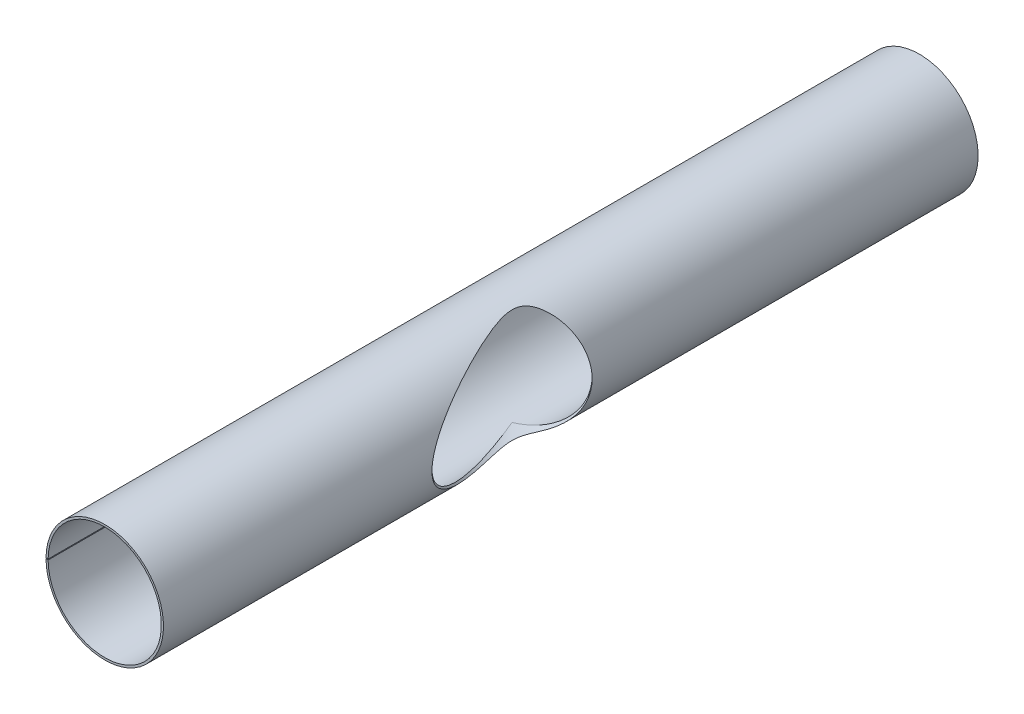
ISO-10303-21;
HEADER;
FILE_DESCRIPTION(('STEP AP214'),'2;1');
FILE_NAME('part.step','',(''),(''),'','','');
FILE_SCHEMA(('AUTOMOTIVE_DESIGN { 1 0 10303 214 1 1 1 1 }'));
ENDSEC;
DATA;
#1=APPLICATION_CONTEXT('core data for automotive mechanical design processes');
#2=APPLICATION_PROTOCOL_DEFINITION('international standard','automotive_design',2000,#1);
#3=PRODUCT_CONTEXT('',#1,'mechanical');
#4=PRODUCT('Part','Part','',(#3));
#5=PRODUCT_RELATED_PRODUCT_CATEGORY('part','',(#4));
#6=PRODUCT_DEFINITION_FORMATION('','',#4);
#7=PRODUCT_DEFINITION_CONTEXT('part definition',#1,'design');
#8=PRODUCT_DEFINITION('design','',#6,#7);
#9=PRODUCT_DEFINITION_SHAPE('','',#8);
#10=(LENGTH_UNIT() NAMED_UNIT(*) SI_UNIT(.MILLI.,.METRE.));
#11=(NAMED_UNIT(*) PLANE_ANGLE_UNIT() SI_UNIT($,.RADIAN.));
#12=(NAMED_UNIT(*) SI_UNIT($,.STERADIAN.) SOLID_ANGLE_UNIT());
#13=UNCERTAINTY_MEASURE_WITH_UNIT(LENGTH_MEASURE(1.E-05),#10,'distance_accuracy_value','');
#14=(GEOMETRIC_REPRESENTATION_CONTEXT(3) GLOBAL_UNCERTAINTY_ASSIGNED_CONTEXT((#13)) GLOBAL_UNIT_ASSIGNED_CONTEXT((#10,
#11,#12)) REPRESENTATION_CONTEXT('',''));
#15=CARTESIAN_POINT('',(0.,0.,0.));
#16=DIRECTION('',(0.,0.,1.));
#17=DIRECTION('',(1.,0.,0.));
#18=AXIS2_PLACEMENT_3D('',#15,#16,#17);
#19=CARTESIAN_POINT('',(0.,0.,500.));
#20=DIRECTION('',(0.,0.,-1.));
#21=DIRECTION('',(-1.,0.,0.));
#22=AXIS2_PLACEMENT_3D('',#19,#20,#21);
#23=CYLINDRICAL_SURFACE('',#22,72.1);
#24=CARTESIAN_POINT('',(62.9616539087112,-35.1317539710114,147.767430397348));
#25=CARTESIAN_POINT('',(63.4222890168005,-34.3062233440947,148.91203652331));
#26=CARTESIAN_POINT('',(63.8765526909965,-33.4540330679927,150.040042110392));
#27=CARTESIAN_POINT('',(64.7694261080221,-31.6908219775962,152.255859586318));
#28=CARTESIAN_POINT('',(65.2080352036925,-30.7797987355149,153.343669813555));
#29=CARTESIAN_POINT('',(66.0658621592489,-28.8926729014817,155.470060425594));
#30=CARTESIAN_POINT('',(66.4850760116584,-27.9165569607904,156.508630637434));
#31=CARTESIAN_POINT('',(67.299002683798,-25.8929244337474,158.524115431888));
#32=CARTESIAN_POINT('',(67.6937210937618,-24.8454242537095,159.501044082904));
#33=CARTESIAN_POINT('',(68.3649570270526,-22.9222051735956,161.161667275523));
#34=CARTESIAN_POINT('',(68.6477892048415,-22.062345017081,161.86114844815));
#35=CARTESIAN_POINT('',(69.1913219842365,-20.2935214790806,163.204993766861));
#36=CARTESIAN_POINT('',(69.4520213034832,-19.3845552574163,163.84935471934));
#37=CARTESIAN_POINT('',(69.9462679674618,-17.51743589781,165.070664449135));
#38=CARTESIAN_POINT('',(70.1798609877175,-16.5593695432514,165.647726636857));
#39=CARTESIAN_POINT('',(70.6149871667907,-14.5926887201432,166.722429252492));
#40=CARTESIAN_POINT('',(70.8165331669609,-13.5840947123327,167.220101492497));
#41=CARTESIAN_POINT('',(71.1310486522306,-11.8050393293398,167.996599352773));
#42=CARTESIAN_POINT('',(71.2530932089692,-11.0459507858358,168.297868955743));
#43=CARTESIAN_POINT('',(71.4749649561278,-9.50499596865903,168.845510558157));
#44=CARTESIAN_POINT('',(71.5747948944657,-8.72313252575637,169.091889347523));
#45=CARTESIAN_POINT('',(71.7499215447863,-7.14084107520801,169.524067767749));
#46=CARTESIAN_POINT('',(71.8252411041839,-6.34043110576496,169.709923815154));
#47=CARTESIAN_POINT('',(71.9495582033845,-4.72514994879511,170.016670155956));
#48=CARTESIAN_POINT('',(71.9985557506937,-3.91027876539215,170.137560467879));
#49=CARTESIAN_POINT('',(72.0690513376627,-2.26747223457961,170.311488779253));
#50=CARTESIAN_POINT('',(72.0903942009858,-1.4394893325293,170.364143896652));
#51=CARTESIAN_POINT('',(72.1044339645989,0.218207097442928,170.398781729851));
#52=CARTESIAN_POINT('',(72.097130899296,1.04792062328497,170.380764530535));
#53=CARTESIAN_POINT('',(72.0540927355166,2.70237599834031,170.274582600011));
#54=CARTESIAN_POINT('',(72.0183470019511,3.52711587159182,170.186391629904));
#55=CARTESIAN_POINT('',(71.9194541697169,5.16479956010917,169.942391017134));
#56=CARTESIAN_POINT('',(71.8563070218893,5.97774335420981,169.786581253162));
#57=CARTESIAN_POINT('',(71.7095491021,7.53106796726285,169.424438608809));
#58=CARTESIAN_POINT('',(71.627640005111,8.27259998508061,169.222306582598));
#59=CARTESIAN_POINT('',(71.4432793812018,9.7371758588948,168.76730341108));
#60=CARTESIAN_POINT('',(71.3408293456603,10.4602210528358,168.514435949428));
#61=CARTESIAN_POINT('',(71.1172681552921,11.8854822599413,167.96257580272));
#62=CARTESIAN_POINT('',(70.9961555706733,12.5876966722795,167.663579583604));
#63=CARTESIAN_POINT('',(70.7371579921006,13.9699354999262,167.024092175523));
#64=CARTESIAN_POINT('',(70.5992684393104,14.6499538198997,166.683589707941));
#65=CARTESIAN_POINT('',(70.3286472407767,15.8946277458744,166.015217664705));
#66=CARTESIAN_POINT('',(70.197827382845,16.4622583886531,165.692083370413));
#67=CARTESIAN_POINT('',(69.9262484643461,17.5801176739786,165.021166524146));
#68=CARTESIAN_POINT('',(69.7854909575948,18.1303490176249,164.673387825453));
#69=CARTESIAN_POINT('',(69.3496371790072,19.7559505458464,163.596325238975));
#70=CARTESIAN_POINT('',(69.0410724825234,20.8057178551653,162.833593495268));
#71=CARTESIAN_POINT('',(68.3944836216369,22.8418242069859,161.23471472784));
#72=CARTESIAN_POINT('',(68.056387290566,23.8279970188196,160.39838781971));
#73=CARTESIAN_POINT('',(67.3568105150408,25.7391882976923,158.667167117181));
#74=CARTESIAN_POINT('',(66.9953207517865,26.6641820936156,157.772249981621));
#75=CARTESIAN_POINT('',(66.2724383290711,28.4116461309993,155.981827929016));
#76=CARTESIAN_POINT('',(65.9119818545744,29.2369393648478,155.088682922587));
#77=CARTESIAN_POINT('',(65.1771207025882,30.8404040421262,153.266957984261));
#78=CARTESIAN_POINT('',(64.802718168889,31.6185826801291,152.33838349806));
#79=CARTESIAN_POINT('',(64.0419391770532,33.1324348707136,150.45055071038));
#80=CARTESIAN_POINT('',(63.6555521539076,33.8680691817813,149.491265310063));
#81=CARTESIAN_POINT('',(62.873017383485,35.299561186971,147.547356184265));
#82=CARTESIAN_POINT('',(62.4768692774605,35.9954174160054,146.562731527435));
#83=CARTESIAN_POINT('',(61.6754482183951,37.3519892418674,144.569572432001));
#84=CARTESIAN_POINT('',(61.2701563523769,38.0126202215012,143.560988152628));
#85=CARTESIAN_POINT('',(60.4526139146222,39.2997798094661,141.525136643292));
#86=CARTESIAN_POINT('',(60.0403634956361,39.9263091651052,140.497869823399));
#87=CARTESIAN_POINT('',(59.210109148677,41.1475138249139,138.427492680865));
#88=CARTESIAN_POINT('',(58.7921075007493,41.74220131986,137.384388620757));
#89=CARTESIAN_POINT('',(57.9510646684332,42.9021827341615,135.283946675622));
#90=CARTESIAN_POINT('',(57.5280233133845,43.467475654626,134.226608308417));
#91=CARTESIAN_POINT('',(56.6080094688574,44.6609480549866,131.925177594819));
#92=CARTESIAN_POINT('',(56.1102781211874,45.2842600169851,130.678865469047));
#93=CARTESIAN_POINT('',(55.110002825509,46.4963975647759,128.171432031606));
#94=CARTESIAN_POINT('',(54.6074586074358,47.0852212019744,126.910309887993));
#95=CARTESIAN_POINT('',(53.5983294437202,48.230818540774,124.374844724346));
#96=CARTESIAN_POINT('',(53.0917436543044,48.787585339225,123.100498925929));
#97=CARTESIAN_POINT('',(52.075392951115,49.8709843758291,120.540365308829));
#98=CARTESIAN_POINT('',(51.565628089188,50.3976171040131,119.254577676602));
#99=CARTESIAN_POINT('',(50.5430212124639,51.4231260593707,116.671381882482));
#100=CARTESIAN_POINT('',(50.0301764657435,51.9219716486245,115.37396265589));
#101=CARTESIAN_POINT('',(49.002560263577,52.8928987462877,112.769911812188));
#102=CARTESIAN_POINT('',(48.487788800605,53.3649801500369,111.463280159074));
#103=CARTESIAN_POINT('',(47.4569419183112,54.2837478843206,108.841824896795));
#104=CARTESIAN_POINT('',(46.9408666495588,54.7304370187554,107.527002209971));
#105=CARTESIAN_POINT('',(45.9078839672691,55.5997470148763,104.889724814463));
#106=CARTESIAN_POINT('',(45.3909765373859,56.0223673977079,103.567269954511));
#107=CARTESIAN_POINT('',(44.3570657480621,56.8444962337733,100.915868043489));
#108=CARTESIAN_POINT('',(43.8400624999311,57.2440134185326,99.5869236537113));
#109=CARTESIAN_POINT('',(42.8062881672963,58.0211153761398,96.9225244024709));
#110=CARTESIAN_POINT('',(42.2895170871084,58.3986997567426,95.5870694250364));
#111=CARTESIAN_POINT('',(41.2567621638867,59.1328246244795,92.910062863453));
#112=CARTESIAN_POINT('',(40.7407783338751,59.489364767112,91.5685111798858));
#113=CARTESIAN_POINT('',(39.7101962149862,60.1821886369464,88.8796563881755));
#114=CARTESIAN_POINT('',(39.1955979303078,60.5184723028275,87.5323532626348));
#115=CARTESIAN_POINT('',(38.1687759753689,61.1712711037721,84.8331401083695));
#116=CARTESIAN_POINT('',(37.6565509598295,61.4877991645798,83.481233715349));
#117=CARTESIAN_POINT('',(36.6348639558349,62.1019482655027,80.7721101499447));
#118=CARTESIAN_POINT('',(36.1254019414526,62.3995694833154,79.4148930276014));
#119=CARTESIAN_POINT('',(35.1100928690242,62.9764420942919,76.6952825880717));
#120=CARTESIAN_POINT('',(34.6042456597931,63.2556942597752,75.332889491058));
#121=CARTESIAN_POINT('',(33.5971291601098,63.7963127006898,72.6028885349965));
#122=CARTESIAN_POINT('',(33.095859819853,64.0576791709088,71.2352807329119));
#123=CARTESIAN_POINT('',(32.1997632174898,64.5118909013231,68.7715703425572));
#124=CARTESIAN_POINT('',(31.8038900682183,64.7079120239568,67.6764323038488));
#125=CARTESIAN_POINT('',(31.0165379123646,65.0889825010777,65.4826930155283));
#126=CARTESIAN_POINT('',(30.6250588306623,65.2740320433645,64.3840918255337));
#127=CARTESIAN_POINT('',(29.8473160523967,65.6333087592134,62.1831864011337));
#128=CARTESIAN_POINT('',(29.4610527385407,65.8075351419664,61.0808819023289));
#129=CARTESIAN_POINT('',(28.6948038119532,66.1452456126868,58.8724446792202));
#130=CARTESIAN_POINT('',(28.3148182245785,66.3087296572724,57.7663119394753));
#131=CARTESIAN_POINT('',(27.561823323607,66.6252424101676,55.5482799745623));
#132=CARTESIAN_POINT('',(27.1888254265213,66.7782549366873,54.4363745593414));
#133=CARTESIAN_POINT('',(26.4519757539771,67.0735453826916,52.2081161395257));
#134=CARTESIAN_POINT('',(26.0881239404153,67.2158233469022,51.0917631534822));
#135=CARTESIAN_POINT('',(25.3716242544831,67.4895377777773,48.8543889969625));
#136=CARTESIAN_POINT('',(25.0189741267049,67.6209764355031,47.7333688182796));
#137=CARTESIAN_POINT('',(24.3273328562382,67.8728683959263,45.4858914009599));
#138=CARTESIAN_POINT('',(23.9883415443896,67.9933218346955,44.3594342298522));
#139=CARTESIAN_POINT('',(23.3971569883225,68.1986748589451,42.3390374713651));
#140=CARTESIAN_POINT('',(23.141756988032,68.2857094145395,41.4462541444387));
#141=CARTESIAN_POINT('',(22.6436017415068,68.4525110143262,39.6564961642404));
#142=CARTESIAN_POINT('',(22.4008462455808,68.5322782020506,38.7595215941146));
#143=CARTESIAN_POINT('',(21.9303991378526,68.6842684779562,36.9602349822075));
#144=CARTESIAN_POINT('',(21.7027192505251,68.756485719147,36.0579193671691));
#145=CARTESIAN_POINT('',(21.2659595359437,68.8928246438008,34.2481827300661));
#146=CARTESIAN_POINT('',(21.0568792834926,68.9569465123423,33.3407618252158));
#147=CARTESIAN_POINT('',(20.6620915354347,69.0762649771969,31.5226479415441));
#148=CARTESIAN_POINT('',(20.4763260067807,69.1314838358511,30.6119691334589));
#149=CARTESIAN_POINT('',(20.1330261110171,69.232241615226,28.7845849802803));
#150=CARTESIAN_POINT('',(19.9754952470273,69.2777793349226,27.867878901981));
#151=CARTESIAN_POINT('',(19.6960360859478,69.357748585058,26.029712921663));
#152=CARTESIAN_POINT('',(19.5740611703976,69.392194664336,25.1082608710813));
#153=CARTESIAN_POINT('',(19.3747015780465,69.4481232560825,23.2602810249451));
#154=CARTESIAN_POINT('',(19.2973007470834,69.4696104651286,22.3337551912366));
#155=CARTESIAN_POINT('',(19.2070374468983,69.494615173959,20.6326279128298));
#156=CARTESIAN_POINT('',(19.1855443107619,69.5005375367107,19.8585414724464));
#157=CARTESIAN_POINT('',(19.1897252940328,69.49938578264,18.310247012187));
#158=CARTESIAN_POINT('',(19.2154028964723,69.4923107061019,17.5360389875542));
#159=CARTESIAN_POINT('',(19.3226022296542,69.4625818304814,15.9944028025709));
#160=CARTESIAN_POINT('',(19.403920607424,69.4399847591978,15.2269602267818));
#161=CARTESIAN_POINT('',(19.6306641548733,69.3762289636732,13.7022984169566));
#162=CARTESIAN_POINT('',(19.7760694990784,69.3350759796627,12.9450760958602));
#163=CARTESIAN_POINT('',(20.1076400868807,69.23956375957,11.5710808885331));
#164=CARTESIAN_POINT('',(20.2832858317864,69.1884542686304,10.9515483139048));
#165=CARTESIAN_POINT('',(20.6850124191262,69.0694154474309,9.73072215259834));
#166=CARTESIAN_POINT('',(20.9110864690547,69.0014883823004,9.12942612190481));
#167=CARTESIAN_POINT('',(21.41237503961,68.8475761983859,7.94981251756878));
#168=CARTESIAN_POINT('',(21.6876080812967,68.7615842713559,7.37150370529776));
#169=CARTESIAN_POINT('',(22.2831479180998,68.5709050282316,6.24180237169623));
#170=CARTESIAN_POINT('',(22.6034620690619,68.4662146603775,5.69041426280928));
#171=CARTESIAN_POINT('',(23.3777081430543,68.2063196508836,4.46761834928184));
#172=CARTESIAN_POINT('',(23.8440595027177,68.0451579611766,3.80533718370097));
#173=CARTESIAN_POINT('',(24.8271688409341,67.6926463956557,2.52800105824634));
#174=CARTESIAN_POINT('',(25.3439472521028,67.5012842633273,1.91296542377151));
#175=CARTESIAN_POINT('',(26.4168539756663,67.0886836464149,0.72471396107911));
#176=CARTESIAN_POINT('',(26.9731264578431,66.8673327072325,0.151668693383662));
#177=CARTESIAN_POINT('',(28.1122739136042,66.396460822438,-0.954752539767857));
#178=CARTESIAN_POINT('',(28.6951489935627,66.1469397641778,-1.48812834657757));
#179=CARTESIAN_POINT('',(29.8360092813,65.6398033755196,-2.4828395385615));
#180=CARTESIAN_POINT('',(30.3927412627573,65.3840819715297,-2.94659482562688));
#181=CARTESIAN_POINT('',(31.5164380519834,64.8499132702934,-3.84803191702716));
#182=CARTESIAN_POINT('',(32.0834047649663,64.5714617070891,-4.28570880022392));
#183=CARTESIAN_POINT('',(33.2236037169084,63.9922759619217,-5.138338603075));
#184=CARTESIAN_POINT('',(33.7968396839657,63.6915278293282,-5.5532770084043));
#185=CARTESIAN_POINT('',(34.9459049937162,63.0683832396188,-6.36282712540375));
#186=CARTESIAN_POINT('',(35.5217344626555,62.7459857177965,-6.75743783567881));
#187=CARTESIAN_POINT('',(36.6736330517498,62.0797684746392,-7.52876598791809));
#188=CARTESIAN_POINT('',(37.2497020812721,61.735934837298,-7.90547152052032));
#189=CARTESIAN_POINT('',(38.3994793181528,61.0274202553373,-8.64251239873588));
#190=CARTESIAN_POINT('',(38.9731875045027,60.6627391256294,-9.00284759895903));
#191=CARTESIAN_POINT('',(40.1161701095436,59.9130192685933,-9.70847461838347));
#192=CARTESIAN_POINT('',(40.6854459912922,59.5279876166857,-10.0537715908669));
#193=CARTESIAN_POINT('',(41.8182003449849,58.7377654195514,-10.7306419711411));
#194=CARTESIAN_POINT('',(42.3816783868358,58.3325733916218,-11.0622143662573));
#195=CARTESIAN_POINT('',(43.5602004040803,57.4587856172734,-11.7466989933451));
#196=CARTESIAN_POINT('',(44.1744447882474,56.9880002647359,-12.0981951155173));
#197=CARTESIAN_POINT('',(45.3924513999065,56.0226678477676,-12.7865482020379));
#198=CARTESIAN_POINT('',(45.9962128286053,55.5281189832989,-13.1234040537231));
#199=CARTESIAN_POINT('',(47.1917238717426,54.5157288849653,-13.7832182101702));
#200=CARTESIAN_POINT('',(47.7834732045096,53.9978871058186,-14.1061761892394));
#201=CARTESIAN_POINT('',(48.9535758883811,52.9393998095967,-14.7387532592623));
#202=CARTESIAN_POINT('',(49.5319284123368,52.3987528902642,-15.0483715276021));
#203=CARTESIAN_POINT('',(51.2444380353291,50.7438279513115,-15.9576036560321));
#204=CARTESIAN_POINT('',(52.3567140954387,49.5960023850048,-16.5379602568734));
#205=CARTESIAN_POINT('',(54.5132426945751,47.2154242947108,-17.6491470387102));
#206=CARTESIAN_POINT('',(55.5574901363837,45.9826654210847,-18.1799735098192));
#207=CARTESIAN_POINT('',(57.17005323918,43.9426070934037,-18.9916502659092));
#208=CARTESIAN_POINT('',(57.7627730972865,43.1606282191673,-19.2880984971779));
#209=CARTESIAN_POINT('',(58.9187349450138,41.568739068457,-19.8632161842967));
#210=CARTESIAN_POINT('',(59.481975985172,40.7588278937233,-20.1418850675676));
#211=CARTESIAN_POINT('',(60.5773270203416,39.1123418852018,-20.6813544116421));
#212=CARTESIAN_POINT('',(61.1094344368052,38.2757648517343,-20.9421533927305));
#213=CARTESIAN_POINT('',(62.1409621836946,36.5772894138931,-21.4457321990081));
#214=CARTESIAN_POINT('',(62.640379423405,35.7153886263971,-21.6885103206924));
#215=CARTESIAN_POINT('',(63.6051309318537,33.9675441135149,-22.1558901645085));
#216=CARTESIAN_POINT('',(64.0704548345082,33.0815931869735,-22.3804863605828));
#217=CARTESIAN_POINT('',(64.9654495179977,31.2874629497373,-22.8111881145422));
#218=CARTESIAN_POINT('',(65.3951203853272,30.3792836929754,-23.0172937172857));
#219=CARTESIAN_POINT('',(66.2174655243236,28.5424205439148,-23.4107492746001));
#220=CARTESIAN_POINT('',(66.6101423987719,27.6137380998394,-23.5981005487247));
#221=CARTESIAN_POINT('',(67.357312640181,25.7375598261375,-23.9538043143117));
#222=CARTESIAN_POINT('',(67.7118061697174,24.7900640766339,-24.1221568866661));
#223=CARTESIAN_POINT('',(68.3657106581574,22.923159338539,-24.4321253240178));
#224=CARTESIAN_POINT('',(68.6669299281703,22.0045303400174,-24.5746271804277));
#225=CARTESIAN_POINT('',(69.2328328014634,20.1534515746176,-24.8419444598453));
#226=CARTESIAN_POINT('',(69.4975132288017,19.2210006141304,-24.9667583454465));
#227=CARTESIAN_POINT('',(69.9894978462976,17.34419788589,-25.1984715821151));
#228=CARTESIAN_POINT('',(70.2168061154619,16.3998474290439,-25.3053728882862));
#229=CARTESIAN_POINT('',(70.6334237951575,14.5008440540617,-25.5011073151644));
#230=CARTESIAN_POINT('',(70.8227294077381,13.5461901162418,-25.5899386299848));
#231=CARTESIAN_POINT('',(71.1626697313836,11.6289252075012,-25.7493299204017));
#232=CARTESIAN_POINT('',(71.3133207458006,10.6663177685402,-25.8198975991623));
#233=CARTESIAN_POINT('',(71.5755979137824,8.73463386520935,-25.9426829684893));
#234=CARTESIAN_POINT('',(71.6872239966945,7.76555738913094,-25.9949006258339));
#235=CARTESIAN_POINT('',(71.8711057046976,5.82289260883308,-26.0808874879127));
#236=CARTESIAN_POINT('',(71.9433625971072,4.84930445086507,-26.114657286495));
#237=CARTESIAN_POINT('',(72.0482883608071,2.89953123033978,-26.163687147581));
#238=CARTESIAN_POINT('',(72.0809573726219,1.923346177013,-26.1789472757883));
#239=CARTESIAN_POINT('',(72.1059680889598,0.0190477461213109,-26.1906304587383));
#240=CARTESIAN_POINT('',(72.1002394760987,-0.90903543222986,-26.1879548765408));
#241=CARTESIAN_POINT('',(72.0529691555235,-2.76417041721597,-26.1658722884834));
#242=CARTESIAN_POINT('',(72.0114244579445,-3.69122213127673,-26.1464638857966));
#243=CARTESIAN_POINT('',(71.8926406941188,-5.54241381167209,-26.0909503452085));
#244=CARTESIAN_POINT('',(71.8154062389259,-6.46655413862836,-26.054847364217));
#245=CARTESIAN_POINT('',(71.6254520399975,-8.31046099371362,-25.9660032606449));
#246=CARTESIAN_POINT('',(71.5127289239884,-9.23022709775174,-25.9132605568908));
#247=CARTESIAN_POINT('',(71.2521244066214,-11.0635318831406,-25.7912325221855));
#248=CARTESIAN_POINT('',(71.1042483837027,-11.9770714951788,-25.7219497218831));
#249=CARTESIAN_POINT('',(70.7737447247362,-13.7964628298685,-25.5669535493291));
#250=CARTESIAN_POINT('',(70.5911137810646,-14.7023138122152,-25.4812386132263));
#251=CARTESIAN_POINT('',(69.9918133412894,-17.4057820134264,-25.1996458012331));
#252=CARTESIAN_POINT('',(69.5236677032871,-19.1897950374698,-24.9792879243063));
#253=CARTESIAN_POINT('',(68.4577832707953,-22.7000515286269,-24.4758680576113));
#254=CARTESIAN_POINT('',(67.8606565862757,-24.4265248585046,-24.1931021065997));
#255=CARTESIAN_POINT('',(66.5416705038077,-27.8195704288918,-23.5657386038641));
#256=CARTESIAN_POINT('',(65.8198119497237,-29.486143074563,-23.2211414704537));
#257=CARTESIAN_POINT('',(64.2586782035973,-32.7491073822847,-22.4716606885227));
#258=CARTESIAN_POINT('',(63.419403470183,-34.3454993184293,-22.06677727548));
#259=CARTESIAN_POINT('',(61.6314704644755,-37.4592284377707,-21.1980109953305));
#260=CARTESIAN_POINT('',(60.682810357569,-38.9765642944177,-20.7341271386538));
#261=CARTESIAN_POINT('',(59.1645404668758,-41.2168212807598,-19.9848594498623));
#262=CARTESIAN_POINT('',(58.6312857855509,-41.9718060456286,-19.7205379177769));
#263=CARTESIAN_POINT('',(57.5390371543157,-43.4570887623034,-19.1762467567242));
#264=CARTESIAN_POINT('',(56.9800451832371,-44.1873886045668,-18.8962783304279));
#265=CARTESIAN_POINT('',(55.8376603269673,-45.6224400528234,-18.320643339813));
#266=CARTESIAN_POINT('',(55.2542636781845,-46.3271876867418,-18.0249743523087));
#267=CARTESIAN_POINT('',(54.0646917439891,-47.7100708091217,-17.417902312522));
#268=CARTESIAN_POINT('',(53.4585183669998,-48.3882085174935,-17.1065005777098));
#269=CARTESIAN_POINT('',(52.2243195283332,-49.7177432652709,-16.467418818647));
#270=CARTESIAN_POINT('',(51.5962730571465,-50.3691132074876,-16.139723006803));
#271=CARTESIAN_POINT('',(50.3206232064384,-51.6435637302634,-15.4680132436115));
#272=CARTESIAN_POINT('',(49.6730213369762,-52.2666464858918,-15.1240005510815));
#273=CARTESIAN_POINT('',(48.3600972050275,-53.4837562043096,-14.4191508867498));
#274=CARTESIAN_POINT('',(47.6947771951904,-54.077786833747,-14.0583160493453));
#275=CARTESIAN_POINT('',(46.3482944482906,-55.2361677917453,-13.3190333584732));
#276=CARTESIAN_POINT('',(45.6671321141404,-55.8005188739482,-12.9405859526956));
#277=CARTESIAN_POINT('',(44.3898962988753,-56.8200280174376,-12.220704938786));
#278=CARTESIAN_POINT('',(43.7956454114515,-57.2792310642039,-11.8817569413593));
#279=CARTESIAN_POINT('',(42.5986084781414,-58.1749715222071,-11.1892997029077));
#280=CARTESIAN_POINT('',(41.9958225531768,-58.6115092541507,-10.8357906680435));
#281=CARTESIAN_POINT('',(40.7832381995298,-59.4616337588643,-10.112993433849));
#282=CARTESIAN_POINT('',(40.1734378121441,-59.8752139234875,-9.74370074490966));
#283=CARTESIAN_POINT('',(38.948956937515,-60.6788679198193,-8.988013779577));
#284=CARTESIAN_POINT('',(38.3342764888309,-61.0689419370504,-8.60161963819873));
#285=CARTESIAN_POINT('',(37.103464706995,-61.8244557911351,-7.81065600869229));
#286=CARTESIAN_POINT('',(36.4873380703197,-62.1899392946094,-7.406120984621));
#287=CARTESIAN_POINT('',(35.2553167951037,-62.8965566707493,-6.57599918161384));
#288=CARTESIAN_POINT('',(34.639422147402,-63.237691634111,-6.15041334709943));
#289=CARTESIAN_POINT('',(33.411674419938,-63.8948701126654,-5.27567856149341));
#290=CARTESIAN_POINT('',(32.7998189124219,-64.2109302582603,-4.8265455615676));
#291=CARTESIAN_POINT('',(31.5841653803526,-64.817526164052,-3.90113041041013));
#292=CARTESIAN_POINT('',(30.9803657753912,-65.1080669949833,-3.42485368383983));
#293=CARTESIAN_POINT('',(29.8169113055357,-65.6487004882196,-2.46624193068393));
#294=CARTESIAN_POINT('',(29.2565811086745,-65.9001036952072,-1.98547197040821));
#295=CARTESIAN_POINT('',(28.1541899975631,-66.3785543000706,-0.99177955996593));
#296=CARTESIAN_POINT('',(27.612128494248,-66.6056024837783,-0.478858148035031));
#297=CARTESIAN_POINT('',(26.5549686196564,-67.0340832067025,0.582392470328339));
#298=CARTESIAN_POINT('',(26.0398242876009,-67.2355603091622,1.13065749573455));
#299=CARTESIAN_POINT('',(25.0451174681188,-67.6123863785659,2.26715236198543));
#300=CARTESIAN_POINT('',(24.5655477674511,-67.7877406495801,2.85537405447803));
#301=CARTESIAN_POINT('',(23.7288464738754,-68.0846178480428,3.97292664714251));
#302=CARTESIAN_POINT('',(23.3646042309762,-68.2102448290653,4.4958278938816));
#303=CARTESIAN_POINT('',(22.6753173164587,-68.4424742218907,5.57092654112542));
#304=CARTESIAN_POINT('',(22.3502671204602,-68.5490793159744,6.12311979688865));
#305=CARTESIAN_POINT('',(21.7457833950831,-68.7432304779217,7.25415235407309));
#306=CARTESIAN_POINT('',(21.4662837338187,-68.830804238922,7.83295143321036));
#307=CARTESIAN_POINT('',(20.9565438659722,-68.9877130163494,9.01425099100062));
#308=CARTESIAN_POINT('',(20.72630412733,-69.0570478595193,9.61675169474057));
#309=CARTESIAN_POINT('',(20.3170699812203,-69.1785533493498,10.8393176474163));
#310=CARTESIAN_POINT('',(20.1379844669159,-69.2307545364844,11.4593494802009));
#311=CARTESIAN_POINT('',(19.8293327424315,-69.3197905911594,12.712623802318));
#312=CARTESIAN_POINT('',(19.6997694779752,-69.3566245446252,13.3458670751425));
#313=CARTESIAN_POINT('',(19.4866004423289,-69.4168182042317,14.6216268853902));
#314=CARTESIAN_POINT('',(19.4030712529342,-69.4401554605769,15.2641570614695));
#315=CARTESIAN_POINT('',(19.2775506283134,-69.4751046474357,16.5534466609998));
#316=CARTESIAN_POINT('',(19.2355597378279,-69.4867164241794,17.2002061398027));
#317=CARTESIAN_POINT('',(19.1821059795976,-69.5014954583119,18.6521727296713));
#318=CARTESIAN_POINT('',(19.1805203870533,-69.5019307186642,19.4577549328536));
#319=CARTESIAN_POINT('',(19.2237724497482,-69.4899765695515,21.0677207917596));
#320=CARTESIAN_POINT('',(19.2686316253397,-69.477581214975,21.8721037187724));
#321=CARTESIAN_POINT('',(19.3964763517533,-69.4419977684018,23.4788962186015));
#322=CARTESIAN_POINT('',(19.4795285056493,-69.4187908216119,24.281299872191));
#323=CARTESIAN_POINT('',(19.6767537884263,-69.3631444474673,25.881747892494));
#324=CARTESIAN_POINT('',(19.7909225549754,-69.3307063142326,26.6797928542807));
#325=CARTESIAN_POINT('',(20.0458408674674,-69.2574327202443,28.278328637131));
#326=CARTESIAN_POINT('',(20.1868133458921,-69.2165265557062,29.0787801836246));
#327=CARTESIAN_POINT('',(20.490060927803,-69.1273634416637,30.6752060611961));
#328=CARTESIAN_POINT('',(20.6523365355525,-69.0791063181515,31.4711802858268));
#329=CARTESIAN_POINT('',(20.9943372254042,-68.9759354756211,33.0580385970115));
#330=CARTESIAN_POINT('',(21.1740439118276,-68.9210287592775,33.8489271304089));
#331=CARTESIAN_POINT('',(21.54812654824,-68.8049896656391,35.4267308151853));
#332=CARTESIAN_POINT('',(21.7425021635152,-68.7438574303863,36.2136460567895));
#333=CARTESIAN_POINT('',(22.1652902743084,-68.6087773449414,37.8688303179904));
#334=CARTESIAN_POINT('',(22.3951095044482,-68.534158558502,38.7366841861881));
#335=CARTESIAN_POINT('',(22.8673416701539,-68.3780414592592,40.4683504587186));
#336=CARTESIAN_POINT('',(23.1097549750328,-68.2965429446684,41.332162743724));
#337=CARTESIAN_POINT('',(23.6051687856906,-68.1269004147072,43.0562026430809));
#338=CARTESIAN_POINT('',(23.8581706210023,-68.0387555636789,43.9164297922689));
#339=CARTESIAN_POINT('',(24.3731087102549,-67.8559967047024,45.6335210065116));
#340=CARTESIAN_POINT('',(24.6350450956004,-67.7613826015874,46.4903850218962));
#341=CARTESIAN_POINT('',(25.4324658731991,-67.4679195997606,49.0572430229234));
#342=CARTESIAN_POINT('',(25.9793078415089,-67.2595362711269,50.7626296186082));
#343=CARTESIAN_POINT('',(27.0951457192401,-66.8178383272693,54.1627182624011));
#344=CARTESIAN_POINT('',(27.6641402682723,-66.5845252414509,55.8574209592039));
#345=CARTESIAN_POINT('',(28.8200778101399,-66.0924249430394,59.2412474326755));
#346=CARTESIAN_POINT('',(29.4070578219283,-65.8335823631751,60.9303504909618));
#347=CARTESIAN_POINT('',(30.5937040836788,-65.2905899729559,64.3000278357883));
#348=CARTESIAN_POINT('',(31.1933705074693,-65.0064398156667,65.9806020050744));
#349=CARTESIAN_POINT('',(32.4021773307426,-64.4124393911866,69.3331960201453));
#350=CARTESIAN_POINT('',(33.0113148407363,-64.1025968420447,71.0052182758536));
#351=CARTESIAN_POINT('',(34.2369070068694,-63.4564744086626,74.3414458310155));
#352=CARTESIAN_POINT('',(34.8533616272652,-63.1201946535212,76.005651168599));
#353=CARTESIAN_POINT('',(36.0898506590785,-62.4214344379,79.3212013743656));
#354=CARTESIAN_POINT('',(36.7098683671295,-62.0590372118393,80.9725700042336));
#355=CARTESIAN_POINT('',(37.953844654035,-61.306152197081,84.2674096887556));
#356=CARTESIAN_POINT('',(38.5778032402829,-60.9156643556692,85.910880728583));
#357=CARTESIAN_POINT('',(39.8284763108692,-60.1053888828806,89.1898109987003));
#358=CARTESIAN_POINT('',(40.4551911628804,-59.6855972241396,90.8252690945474));
#359=CARTESIAN_POINT('',(41.7101749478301,-58.8154264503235,94.0874316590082));
#360=CARTESIAN_POINT('',(42.3384438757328,-58.3650474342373,95.7141361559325));
#361=CARTESIAN_POINT('',(43.5945092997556,-57.432912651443,98.9554938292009));
#362=CARTESIAN_POINT('',(44.2223049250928,-56.9512086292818,100.570162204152));
#363=CARTESIAN_POINT('',(45.4774847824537,-55.9540070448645,103.789230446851));
#364=CARTESIAN_POINT('',(46.1048690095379,-55.4385090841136,105.393630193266));
#365=CARTESIAN_POINT('',(47.3581612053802,-54.3717909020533,108.590750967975));
#366=CARTESIAN_POINT('',(47.9840694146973,-53.8205769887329,110.183474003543));
#367=CARTESIAN_POINT('',(49.233524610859,-52.6800305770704,113.356094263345));
#368=CARTESIAN_POINT('',(49.8570716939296,-52.0906996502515,114.935992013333));
#369=CARTESIAN_POINT('',(51.0201620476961,-50.9502460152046,117.877418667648));
#370=CARTESIAN_POINT('',(51.5601159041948,-50.4040746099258,119.240704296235));
#371=CARTESIAN_POINT('',(52.6366959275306,-49.2787443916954,121.954907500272));
#372=CARTESIAN_POINT('',(53.1733221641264,-48.6995862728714,123.305825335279));
#373=CARTESIAN_POINT('',(54.2426283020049,-47.505681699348,125.994207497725));
#374=CARTESIAN_POINT('',(54.7753064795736,-46.890920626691,127.331666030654));
#375=CARTESIAN_POINT('',(55.835511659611,-45.6233318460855,129.990522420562));
#376=CARTESIAN_POINT('',(56.3630386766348,-44.9705042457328,131.311920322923));
#377=CARTESIAN_POINT('',(57.410464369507,-43.6253760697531,133.932834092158));
#378=CARTESIAN_POINT('',(57.9303789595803,-42.9331794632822,135.232396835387));
#379=CARTESIAN_POINT('',(58.9625865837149,-41.5042210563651,137.810018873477));
#380=CARTESIAN_POINT('',(59.474879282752,-40.7674573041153,139.088077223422));
#381=CARTESIAN_POINT('',(60.4898278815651,-39.2457230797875,141.617980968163));
#382=CARTESIAN_POINT('',(60.9924894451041,-38.460782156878,142.869841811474));
#383=CARTESIAN_POINT('',(61.9863302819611,-36.8376235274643,145.343054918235));
#384=CARTESIAN_POINT('',(62.4775112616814,-35.9994138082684,146.564411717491));
#385=CARTESIAN_POINT('',(62.9616539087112,-35.1317539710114,147.767430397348));
#386=B_SPLINE_CURVE_WITH_KNOTS('',3,(#24,#25,#26,#27,#28,#29,#30,#31,#32,#33,#34,#35,#36,#37,
#38,#39,#40,#41,#42,#43,#44,#45,#46,#47,#48,#49,#50,#51,#52,#53,#54,#55,#56,#57,#58,#59,#60,#61,
#62,#63,#64,#65,#66,#67,#68,#69,#70,#71,#72,#73,#74,#75,#76,#77,#78,#79,#80,#81,#82,#83,#84,#85,
#86,#87,#88,#89,#90,#91,#92,#93,#94,#95,#96,#97,#98,#99,#100,#101,#102,#103,#104,#105,#106,#107,
#108,#109,#110,#111,#112,#113,#114,#115,#116,#117,#118,#119,#120,#121,#122,#123,#124,#125,#126,
#127,#128,#129,#130,#131,#132,#133,#134,#135,#136,#137,#138,#139,#140,#141,#142,#143,#144,#145,
#146,#147,#148,#149,#150,#151,#152,#153,#154,#155,#156,#157,#158,#159,#160,#161,#162,#163,#164,
#165,#166,#167,#168,#169,#170,#171,#172,#173,#174,#175,#176,#177,#178,#179,#180,#181,#182,#183,
#184,#185,#186,#187,#188,#189,#190,#191,#192,#193,#194,#195,#196,#197,#198,#199,#200,#201,#202,
#203,#204,#205,#206,#207,#208,#209,#210,#211,#212,#213,#214,#215,#216,#217,#218,#219,#220,#221,
#222,#223,#224,#225,#226,#227,#228,#229,#230,#231,#232,#233,#234,#235,#236,#237,#238,#239,#240,
#241,#242,#243,#244,#245,#246,#247,#248,#249,#250,#251,#252,#253,#254,#255,#256,#257,#258,#259,
#260,#261,#262,#263,#264,#265,#266,#267,#268,#269,#270,#271,#272,#273,#274,#275,#276,#277,#278,
#279,#280,#281,#282,#283,#284,#285,#286,#287,#288,#289,#290,#291,#292,#293,#294,#295,#296,#297,
#298,#299,#300,#301,#302,#303,#304,#305,#306,#307,#308,#309,#310,#311,#312,#313,#314,#315,#316,
#317,#318,#319,#320,#321,#322,#323,#324,#325,#326,#327,#328,#329,#330,#331,#332,#333,#334,#335,
#336,#337,#338,#339,#340,#341,#342,#343,#344,#345,#346,#347,#348,#349,#350,#351,#352,#353,#354,
#355,#356,#357,#358,#359,#360,#361,#362,#363,#364,#365,#366,#367,#368,#369,#370,#371,#372,#373,
#374,#375,#376,#377,#378,#379,#380,#381,#382,#383,#384,#385),.UNSPECIFIED.,.T.,.F.,(4,2,2,2,2,2,
2,2,2,2,2,2,2,2,2,2,2,2,2,2,2,2,2,2,2,2,2,2,2,2,2,2,2,2,2,2,2,2,2,2,2,2,2,2,2,2,2,2,2,2,2,2,2,2,
2,2,2,2,2,2,2,2,2,2,2,2,2,2,2,2,2,2,2,2,2,2,2,2,2,2,2,2,2,2,2,2,2,2,2,2,2,2,2,2,2,2,2,2,2,2,2,2,
2,2,2,2,2,2,2,2,2,2,2,2,2,2,2,2,2,2,2,2,2,2,2,2,2,2,2,2,2,2,2,2,2,2,2,2,2,2,2,2,2,2,2,2,2,2,2,2,
2,2,2,2,2,2,2,2,2,2,2,2,2,2,2,2,2,2,2,2,2,2,2,2,2,2,2,2,2,2,4),(0.,4.45320466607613,
8.90659321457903,13.3608978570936,17.8141821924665,21.2438479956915,24.673712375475,
28.0977106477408,31.5203334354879,33.9954540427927,36.4702683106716,38.9427690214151,
41.4152690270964,43.9015835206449,46.3878950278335,48.8751366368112,51.3623827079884,
53.6789437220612,55.9953366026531,58.3119070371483,60.6291083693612,62.6267042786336,
64.6239885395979,68.6203273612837,72.6267209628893,76.6347204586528,80.438213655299,
84.2411245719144,88.047488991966,91.8539935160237,95.6692641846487,99.4844512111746,
103.298166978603,107.112012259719,111.550605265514,115.989448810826,120.429244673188,
124.868968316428,129.313494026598,133.758037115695,138.202088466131,142.646228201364,
147.088677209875,151.531205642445,155.973806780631,160.416421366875,164.856098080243,
169.295733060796,173.735181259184,178.174581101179,181.717147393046,185.259653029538,
188.802417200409,192.345195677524,195.893330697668,199.441450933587,202.988852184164,
206.536209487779,209.334104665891,212.131944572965,214.931935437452,217.73186227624,
220.524675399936,223.317834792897,226.107315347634,228.895784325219,231.217757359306,
233.539901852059,235.853604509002,238.166591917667,240.102238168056,242.037623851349,
243.973740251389,245.910172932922,248.383671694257,250.858176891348,253.342232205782,
255.826297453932,258.130517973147,260.435171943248,262.741280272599,265.04750209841,
267.355237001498,269.662992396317,271.969950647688,274.277078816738,276.826513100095,
279.376140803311,281.92582822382,284.475672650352,289.572528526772,294.669765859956,
297.744007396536,300.818347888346,303.892942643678,306.967827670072,310.04364376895,
313.119452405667,316.195044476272,319.270623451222,322.201295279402,325.132221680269,
328.062827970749,330.993726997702,333.923387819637,336.853053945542,339.782625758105,
342.712187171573,345.495666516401,348.279378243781,351.062730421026,353.846347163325,
356.629538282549,359.412994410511,364.978451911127,370.518055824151,376.057622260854,
381.597167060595,387.136804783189,390.020253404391,392.9034806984,395.787154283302,
398.670586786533,401.556869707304,404.442930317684,407.328625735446,410.214247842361,
412.685621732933,415.156960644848,417.629007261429,420.101034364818,422.568549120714,
425.035953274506,427.501707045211,429.966969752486,432.305725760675,434.644406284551,
436.978953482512,439.313026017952,441.259702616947,443.206104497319,445.149654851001,
447.093223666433,449.033309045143,450.973509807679,452.916928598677,454.860372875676,
457.275289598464,459.691325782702,462.11159125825,464.53151760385,466.972528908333,
469.413598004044,471.852118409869,474.290583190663,476.993027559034,479.695551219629,
482.39841524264,485.101319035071,490.509866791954,495.918082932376,501.338297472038,
506.758586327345,512.177252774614,517.595892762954,522.997968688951,528.400054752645,
533.802884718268,539.205697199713,544.599801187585,549.993968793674,555.387186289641,
560.780181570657,565.474028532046,570.167776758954,574.863466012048,579.559141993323,
584.242946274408,588.9269558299,593.608120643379,598.288585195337),.UNSPECIFIED.);
#387=CARTESIAN_POINT('',(62.9616539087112,-35.1317539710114,147.767430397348));
#388=VERTEX_POINT('',#387);
#389=EDGE_CURVE('E39',#388,#388,#386,.T.);
#390=ORIENTED_EDGE('',*,*,#389,.T.);
#391=EDGE_LOOP('',(#390));
#392=FACE_BOUND('',#391,.T.);
#393=CARTESIAN_POINT('',(0.,0.,-500.));
#394=DIRECTION('',(0.,0.,1.));
#395=DIRECTION('',(1.,0.,0.));
#396=AXIS2_PLACEMENT_3D('',#393,#394,#395);
#397=CIRCLE('',#396,72.1);
#398=CARTESIAN_POINT('',(-72.0981341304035,-0.518705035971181,-500.));
#399=VERTEX_POINT('',#398);
#400=CARTESIAN_POINT('',(-72.0981341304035,0.518705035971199,-500.));
#401=VERTEX_POINT('',#400);
#402=EDGE_CURVE('E119',#399,#401,#397,.T.);
#403=ORIENTED_EDGE('',*,*,#402,.T.);
#404=DIRECTION('',(0.,0.,-1.));
#405=VECTOR('',#404,1.);
#406=CARTESIAN_POINT('',(-72.0981341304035,0.518705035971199,500.));
#407=LINE('',#406,#405);
#408=CARTESIAN_POINT('',(-72.0981341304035,0.518705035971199,500.));
#409=VERTEX_POINT('',#408);
#410=EDGE_CURVE('E102',#409,#401,#407,.T.);
#411=ORIENTED_EDGE('',*,*,#410,.F.);
#412=CARTESIAN_POINT('',(0.,0.,500.));
#413=DIRECTION('',(0.,0.,1.));
#414=DIRECTION('',(1.,0.,0.));
#415=AXIS2_PLACEMENT_3D('',#412,#413,#414);
#416=CIRCLE('',#415,72.1);
#417=CARTESIAN_POINT('',(-72.0981341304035,-0.518705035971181,500.));
#418=VERTEX_POINT('',#417);
#419=EDGE_CURVE('E100',#418,#409,#416,.T.);
#420=ORIENTED_EDGE('',*,*,#419,.F.);
#421=DIRECTION('',(0.,0.,-1.));
#422=VECTOR('',#421,1.);
#423=CARTESIAN_POINT('',(-72.0981341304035,-0.518705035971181,500.));
#424=LINE('',#423,#422);
#425=EDGE_CURVE('E103',#418,#399,#424,.T.);
#426=ORIENTED_EDGE('',*,*,#425,.T.);
#427=EDGE_LOOP('',(#403,#411,#420,#426));
#428=FACE_BOUND('',#427,.T.);
#429=ADVANCED_FACE('F35',(#392,#428),#23,.T.);
#430=CARTESIAN_POINT('',(-69.4982014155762,0.499999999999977,500.));
#431=DIRECTION('',(-0.00719424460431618,-0.999974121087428,0.));
#432=DIRECTION('',(0.999974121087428,-0.00719424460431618,0.));
#433=AXIS2_PLACEMENT_3D('',#430,#431,#432);
#434=PLANE('',#433);
#435=DIRECTION('',(-0.999974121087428,0.00719424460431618,0.));
#436=VECTOR('',#435,1.);
#437=CARTESIAN_POINT('',(-69.4982014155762,0.499999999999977,-500.));
#438=LINE('',#437,#436);
#439=CARTESIAN_POINT('',(-69.4982014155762,0.499999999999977,-500.));
#440=VERTEX_POINT('',#439);
#441=EDGE_CURVE('E86',#440,#401,#438,.T.);
#442=ORIENTED_EDGE('',*,*,#441,.F.);
#443=DIRECTION('',(0.,0.,-1.));
#444=VECTOR('',#443,1.);
#445=CARTESIAN_POINT('',(-69.4982014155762,0.499999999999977,500.));
#446=LINE('',#445,#444);
#447=CARTESIAN_POINT('',(-69.4982014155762,0.499999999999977,500.));
#448=VERTEX_POINT('',#447);
#449=EDGE_CURVE('E81',#448,#440,#446,.T.);
#450=ORIENTED_EDGE('',*,*,#449,.F.);
#451=DIRECTION('',(-0.999974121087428,0.00719424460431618,0.));
#452=VECTOR('',#451,1.);
#453=CARTESIAN_POINT('',(-69.4982014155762,0.499999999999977,500.));
#454=LINE('',#453,#452);
#455=EDGE_CURVE('E84',#448,#409,#454,.T.);
#456=ORIENTED_EDGE('',*,*,#455,.T.);
#457=ORIENTED_EDGE('',*,*,#410,.T.);
#458=EDGE_LOOP('',(#442,#450,#456,#457));
#459=FACE_BOUND('',#458,.T.);
#460=ADVANCED_FACE('F83',(#459),#434,.T.);
#461=CARTESIAN_POINT('',(0.,0.,500.));
#462=DIRECTION('',(0.,0.,-1.));
#463=DIRECTION('',(-1.,0.,0.));
#464=AXIS2_PLACEMENT_3D('',#461,#462,#463);
#465=CYLINDRICAL_SURFACE('',#464,69.5);
#466=CARTESIAN_POINT('',(0.,-1.45361409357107E-13,-5.41233724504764E-13));
#467=DIRECTION('',(0.923879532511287,0.,-0.382683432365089));
#468=DIRECTION('',(-0.382683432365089,0.,-0.923879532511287));
#469=AXIS2_PLACEMENT_3D('',#466,#467,#468);
#470=ELLIPSE('',#469,181.612252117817,69.5);
#471=CARTESIAN_POINT('',(5.68989300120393E-13,-69.5000000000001,-4.71844785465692E-13));
#472=VERTEX_POINT('',#471);
#473=CARTESIAN_POINT('',(5.30912629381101E-13,69.5,-5.1973205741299E-13));
#474=VERTEX_POINT('',#473);
#475=EDGE_CURVE('E47',#472,#474,#470,.F.);
#476=ORIENTED_EDGE('',*,*,#475,.F.);
#477=CARTESIAN_POINT('',(0.,-1.45361409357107E-13,-5.41233724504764E-13));
#478=DIRECTION('',(-0.382683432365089,0.,-0.923879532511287));
#479=DIRECTION('',(0.923879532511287,0.,-0.382683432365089));
#480=AXIS2_PLACEMENT_3D('',#477,#478,#479);
#481=ELLIPSE('',#480,75.2262579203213,69.5);
#482=EDGE_CURVE('E11',#474,#472,#481,.T.);
#483=ORIENTED_EDGE('',*,*,#482,.F.);
#484=EDGE_LOOP('',(#476,#483));
#485=FACE_BOUND('',#484,.T.);
#486=CARTESIAN_POINT('',(0.,0.,-500.));
#487=DIRECTION('',(0.,0.,1.));
#488=DIRECTION('',(1.,0.,0.));
#489=AXIS2_PLACEMENT_3D('',#486,#487,#488);
#490=CIRCLE('',#489,69.5);
#491=CARTESIAN_POINT('',(-69.4982014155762,-0.49999999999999,-500.));
#492=VERTEX_POINT('',#491);
#493=EDGE_CURVE('E113',#492,#440,#490,.T.);
#494=ORIENTED_EDGE('',*,*,#493,.F.);
#495=DIRECTION('',(0.,0.,-1.));
#496=VECTOR('',#495,1.);
#497=CARTESIAN_POINT('',(-69.4982014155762,-0.49999999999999,500.));
#498=LINE('',#497,#496);
#499=CARTESIAN_POINT('',(-69.4982014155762,-0.49999999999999,500.));
#500=VERTEX_POINT('',#499);
#501=EDGE_CURVE('E106',#500,#492,#498,.T.);
#502=ORIENTED_EDGE('',*,*,#501,.F.);
#503=CARTESIAN_POINT('',(0.,0.,500.));
#504=DIRECTION('',(0.,0.,1.));
#505=DIRECTION('',(1.,0.,0.));
#506=AXIS2_PLACEMENT_3D('',#503,#504,#505);
#507=CIRCLE('',#506,69.5);
#508=EDGE_CURVE('E92',#500,#448,#507,.T.);
#509=ORIENTED_EDGE('',*,*,#508,.T.);
#510=ORIENTED_EDGE('',*,*,#449,.T.);
#511=EDGE_LOOP('',(#494,#502,#509,#510));
#512=FACE_BOUND('',#511,.T.);
#513=ADVANCED_FACE('F105',(#485,#512),#465,.F.);
#514=CARTESIAN_POINT('',(-72.0981341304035,-0.518705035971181,500.));
#515=DIRECTION('',(-0.00719424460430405,0.999974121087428,0.));
#516=DIRECTION('',(-0.999974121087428,-0.00719424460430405,0.));
#517=AXIS2_PLACEMENT_3D('',#514,#515,#516);
#518=PLANE('',#517);
#519=DIRECTION('',(0.999974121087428,0.00719424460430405,0.));
#520=VECTOR('',#519,1.);
#521=CARTESIAN_POINT('',(-72.0981341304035,-0.518705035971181,-500.));
#522=LINE('',#521,#520);
#523=EDGE_CURVE('E111',#399,#492,#522,.T.);
#524=ORIENTED_EDGE('',*,*,#523,.F.);
#525=ORIENTED_EDGE('',*,*,#425,.F.);
#526=DIRECTION('',(0.999974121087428,0.00719424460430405,0.));
#527=VECTOR('',#526,1.);
#528=CARTESIAN_POINT('',(-72.0981341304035,-0.518705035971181,500.));
#529=LINE('',#528,#527);
#530=EDGE_CURVE('E91',#418,#500,#529,.T.);
#531=ORIENTED_EDGE('',*,*,#530,.T.);
#532=ORIENTED_EDGE('',*,*,#501,.T.);
#533=EDGE_LOOP('',(#524,#525,#531,#532));
#534=FACE_BOUND('',#533,.T.);
#535=ADVANCED_FACE('F147',(#534),#518,.T.);
#536=CARTESIAN_POINT('',(0.,0.,500.));
#537=DIRECTION('',(0.,0.,1.));
#538=DIRECTION('',(1.,0.,0.));
#539=AXIS2_PLACEMENT_3D('',#536,#537,#538);
#540=PLANE('',#539);
#541=ORIENTED_EDGE('',*,*,#419,.T.);
#542=ORIENTED_EDGE('',*,*,#455,.F.);
#543=ORIENTED_EDGE('',*,*,#508,.F.);
#544=ORIENTED_EDGE('',*,*,#530,.F.);
#545=EDGE_LOOP('',(#541,#542,#543,#544));
#546=FACE_BOUND('',#545,.T.);
#547=ADVANCED_FACE('F96',(#546),#540,.T.);
#548=CARTESIAN_POINT('',(0.,0.,-500.));
#549=DIRECTION('',(0.,0.,1.));
#550=DIRECTION('',(1.,0.,0.));
#551=AXIS2_PLACEMENT_3D('',#548,#549,#550);
#552=PLANE('',#551);
#553=ORIENTED_EDGE('',*,*,#402,.F.);
#554=ORIENTED_EDGE('',*,*,#523,.T.);
#555=ORIENTED_EDGE('',*,*,#493,.T.);
#556=ORIENTED_EDGE('',*,*,#441,.T.);
#557=EDGE_LOOP('',(#553,#554,#555,#556));
#558=FACE_BOUND('',#557,.T.);
#559=ADVANCED_FACE('F131',(#558),#552,.F.);
#560=CARTESIAN_POINT('',(2.77555756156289E-13,-2.90722818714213E-13,-2.22044604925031E-13));
#561=DIRECTION('',(0.707106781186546,0.,0.707106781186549));
#562=DIRECTION('',(-0.610113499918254,-0.505492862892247,0.610113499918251));
#563=AXIS2_PLACEMENT_3D('',#560,#561,#562);
#564=CYLINDRICAL_SURFACE('',#563,69.5);
#565=ORIENTED_EDGE('',*,*,#475,.T.);
#566=ORIENTED_EDGE('',*,*,#482,.T.);
#567=EDGE_LOOP('',(#565,#566));
#568=FACE_BOUND('',#567,.T.);
#569=ORIENTED_EDGE('',*,*,#389,.F.);
#570=EDGE_LOOP('',(#569));
#571=FACE_BOUND('',#570,.T.);
#572=ADVANCED_FACE('F129',(#568,#571),#564,.F.);
#573=CLOSED_SHELL('',(#429,#460,#513,#535,#547,#559,#572));
#574=MANIFOLD_SOLID_BREP('B2',#573);
#575=ADVANCED_BREP_SHAPE_REPRESENTATION('',(#18,#574),#14);
#576=SHAPE_DEFINITION_REPRESENTATION(#9,#575);
ENDSEC;
END-ISO-10303-21;
